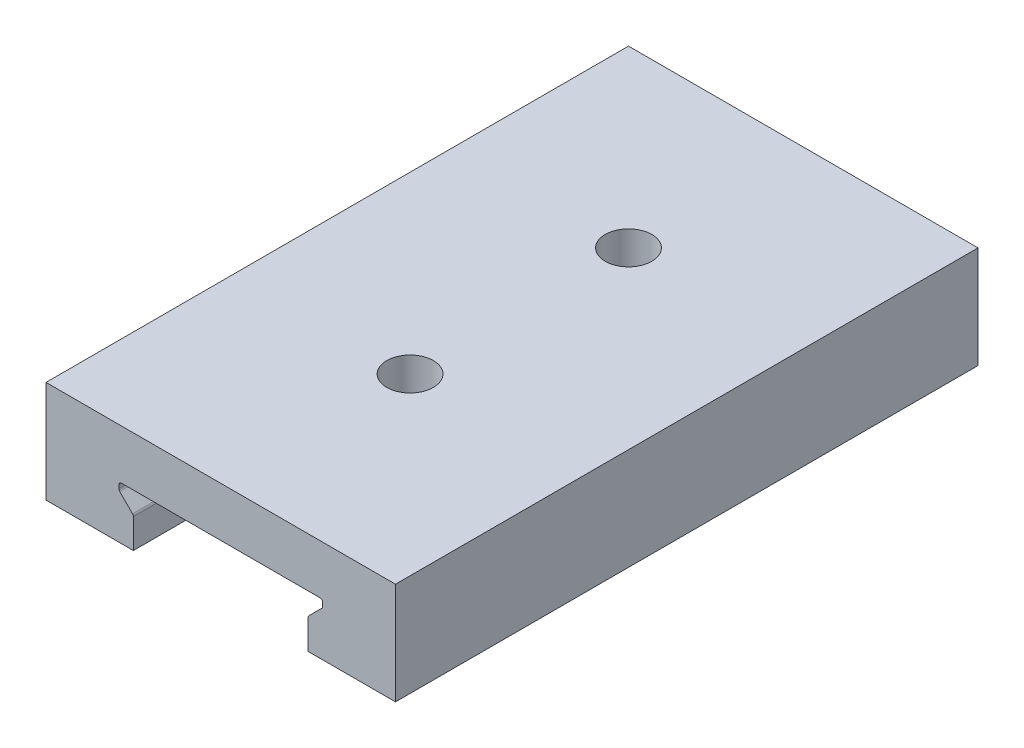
from build123d import *

# Parameters (mm, degrees)
SKETCH1_W             = 12
SKETCH1_H             = 3.5
EXTRUDE1_DEPTH        = 20
CUT_EXTRUDE1_DEPTH    = 22.360009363
FILLET1_R             = 0.1
FILLET1_OF_MIRROR1_R  = 0.1
M2X0_4_TAPPED_HOLE1_D = 1.6


with BuildPart() as part:
    # Sketch1 → Extrude1 (new body)
    with BuildSketch(Plane.XY):
        with Locations((0, 2.75)):
            Rectangle(SKETCH1_W, SKETCH1_H)
    extrude(amount=EXTRUDE1_DEPTH)

    # Sketch2 → Cut-Extrude1 (cut, through all)
    with BuildSketch(Plane(origin=(0, 0, 0), x_dir=(-1, 0, 0), z_dir=(0, 0, -1))):
        Polygon((0, 2.8), (3.5, 2.8), (3.5, 2.55), (3, 2.05), (3, 0), (0, 0), align=None)
    cut_extrude1 = extrude(amount=-CUT_EXTRUDE1_DEPTH, mode=Mode.SUBTRACT)

    # Fillet1
    fillet1_edges = [part.edges().sort_by_distance(p)[0] for p in [
        (-3, 2.05, 10),
        (-3.5, 2.8, 10),
        (-3.5, 2.55, 10),
    ]]
    fillet(fillet1_edges, radius=FILLET1_R)

    # Mirror1: Cut-Extrude1 across plane
    add(cut_extrude1.mirror(Plane(origin=(0, 0, 0), x_dir=(0, 0, 1), z_dir=(1, 0, 0))), mode=Mode.SUBTRACT)

    # Fillet1 of Mirror1
    fillet1_of_mirror1_edges = [part.edges().sort_by_distance(p)[0] for p in [
        (3, 2.05, 10),
        (3.5, 2.8, 10),
        (3.5, 2.55, 10),
    ]]
    fillet(fillet1_of_mirror1_edges, radius=FILLET1_OF_MIRROR1_R)

    # M2x0.4 Tapped Hole1 (through all)
    with Locations(Plane(origin=(0, 4.5, 0), x_dir=(-1, 0, 0), z_dir=(0, 1, 0))):
        with Locations((0, 6), (0, 13.5)):
            Hole(M2X0_4_TAPPED_HOLE1_D / 2)


solid = part.part
